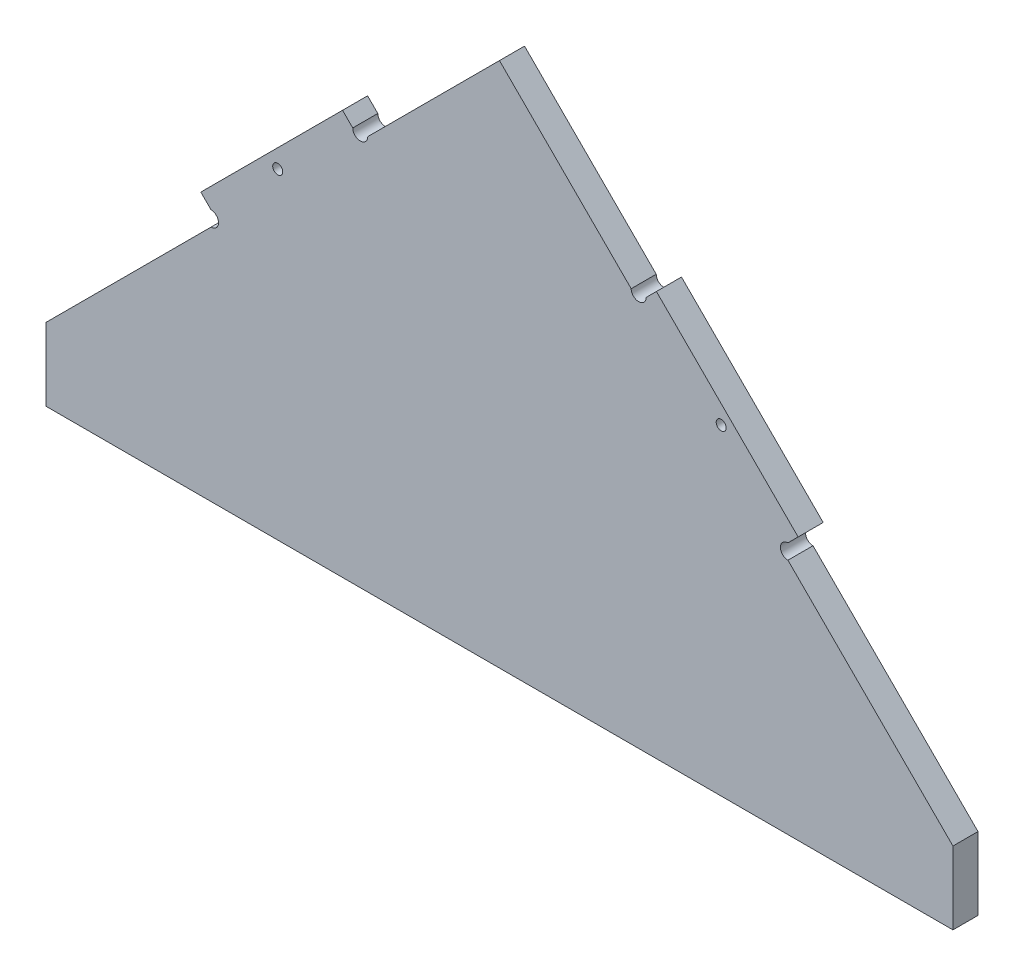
from build123d import *

# Parameters (mm, degrees)
ESQUISSE1_R        = 1
BOSS_EXTRU_1_DEPTH = 5


with BuildPart() as part:
    # Esquisse1 → Boss.-Extru.1 (new body)
    with BuildSketch(Plane.XY):
        with BuildLine():
            Line((90.5, 0), (-90.5, 0))
            Line((-90.5, 0), (-90.5, 14.5))
            Line((-90.5, 14.5), (-57.568542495, 47.431457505))
            ThreePointArc((-57.568542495, 47.431457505), (-56.068542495, 48.931457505), (-57.568542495, 50.431457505))
            Line((-57.568542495, 50.431457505), (-59.604076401, 52.466991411))
            Line((-59.604076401, 52.466991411), (-31.319805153, 80.751262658))
            Line((-31.319805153, 80.751262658), (-29.284271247, 78.715728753))
            ThreePointArc((-29.284271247, 78.715728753), (-27.784271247, 77.215728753), (-26.284271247, 78.715728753))
            Line((-26.284271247, 78.715728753), (0, 105))
            Line((0, 105), (26.284271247, 78.715728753))
            ThreePointArc((26.284271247, 78.715728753), (27.784271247, 77.215728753), (29.284271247, 78.715728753))
            Line((29.284271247, 78.715728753), (31.319805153, 80.751262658))
            Line((31.319805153, 80.751262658), (59.604076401, 52.466991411))
            Line((59.604076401, 52.466991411), (57.568542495, 50.431457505))
            ThreePointArc((57.568542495, 50.431457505), (56.068542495, 48.931457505), (57.568542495, 47.431457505))
            Line((57.568542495, 47.431457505), (90.5, 14.5))
            Line((90.5, 14.5), (90.5, 0))
        make_face()
        with Locations(Location((-44.253393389, 64.122363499, 0), (0, 0, 180))):
            Circle(ESQUISSE1_R, mode=Mode.SUBTRACT)
        with Locations((44.253393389, 64.122363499)):
            Circle(ESQUISSE1_R, mode=Mode.SUBTRACT)
    extrude(amount=BOSS_EXTRU_1_DEPTH)


solid = part.part
